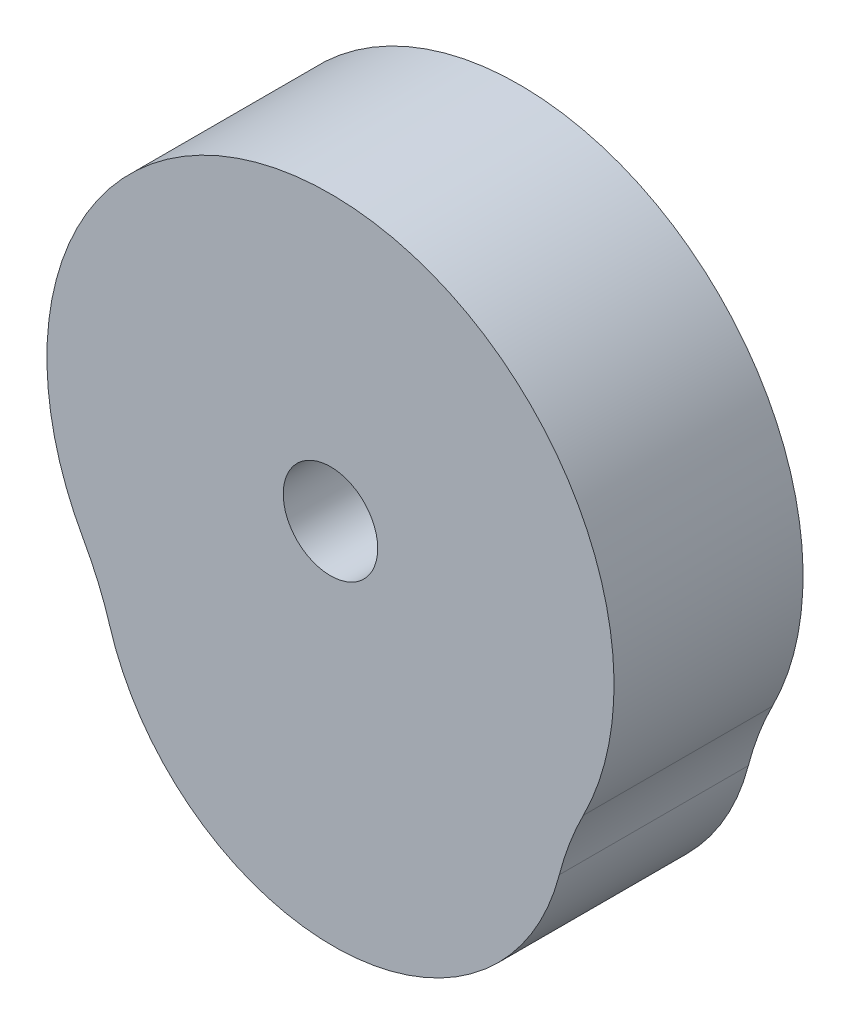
from build123d import *

# Parameters (mm, degrees)
BOSS_EXTRUDE1_DEPTH      = 3
BOSS_EXTRUDE1_DEPTH_BACK = 3
SKETCH1_R                = 1.5


with BuildPart() as part:
    # Sketch1 → Boss-Extrude1 (new, two sides: drawn at the far end of the back side and taken through both)
    with BuildSketch(Plane.XY.offset(-BOSS_EXTRUDE1_DEPTH_BACK)):
        with BuildLine():
            ThreePointArc((-7.003381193, -6.384659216), (0.242869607, -11.636773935), (7.263673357, -6.086893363))
            ThreePointArc((7.263673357, -6.086893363), (7.590334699, -5.059253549), (8.025747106, -4.07276115))
            ThreePointArc((8.025747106, -4.07276115), (8.98859951, 0.452856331), (7.575765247, 4.858783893))
            ThreePointArc((7.575765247, 4.858783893), (-4.633442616, 7.715647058), (-7.848828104, -4.40407736))
            ThreePointArc((-7.848828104, -4.40407736), (-7.372634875, -5.371543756), (-7.003381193, -6.384659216))
        make_face()
        Circle(SKETCH1_R, mode=Mode.SUBTRACT)
    extrude(amount=BOSS_EXTRUDE1_DEPTH + BOSS_EXTRUDE1_DEPTH_BACK)


solid = part.part
